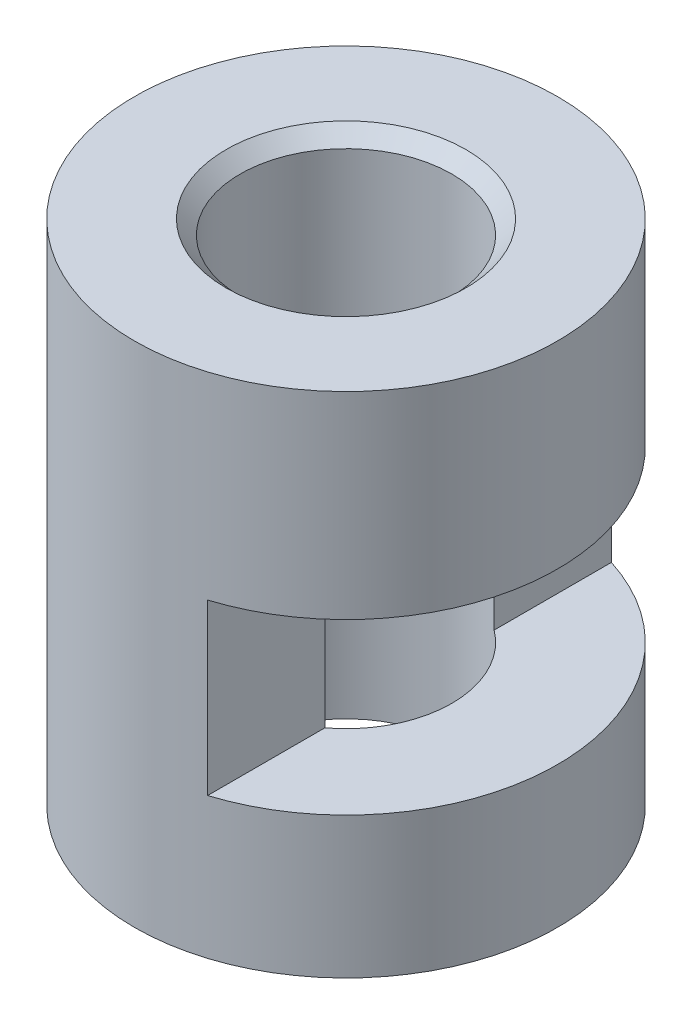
from build123d import *

# Parameters (mm, degrees)
SKETCH1_R               = 3
BOSS_EXTRUDE1_DEPTH     = 7.2
CUT_EXTRUDE1_REACH      = 10.357
SKETCH2_R               = 1.5
CUT_EXTRUDE2_DEPTH      = 9.357032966
CUT_EXTRUDE2_DEPTH_BACK = 9.357032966
SKETCH3_W               = 2.1
SKETCH3_H               = 2.4
CHAMFER1_SIZE           = 0.2


with BuildPart() as part:
    # Sketch1 → Boss-Extrude1 (new body)
    with BuildSketch(Plane(origin=(0, 0, 0), x_dir=(1, 0, 0), z_dir=(0, 1, 0))):
        with Locations(Location((0, 0, 0), (0, 0, 270))):
            Circle(SKETCH1_R)
    extrude(amount=BOSS_EXTRUDE1_DEPTH)

    # Sketch2 → Cut-Extrude1 (cut, up to next)
    with BuildSketch(Plane(origin=(0, 7.2, 0), x_dir=(1, 0, 0), z_dir=(0, 1, 0)), mode=Mode.PRIVATE) as cut_extrude1_sk1:
        with Locations(Location((0, 0, 0), (0, 0, 270))):
            Circle(SKETCH2_R)
    cut_extrude1_tool1 = extrude(cut_extrude1_sk1.sketch, amount=-CUT_EXTRUDE1_REACH, mode=Mode.PRIVATE) & part.part
    add(cut_extrude1_tool1.solids().sort_by_distance((0, 7.2, 0))[0], mode=Mode.SUBTRACT)

    # Sketch3 → Cut-Extrude2 (cut, two sides: drawn at the far end of the back side and taken through both)
    with BuildSketch(Plane.XY.offset(-CUT_EXTRUDE2_DEPTH_BACK)):
        with Locations((1.95, 3.2)):
            Rectangle(SKETCH3_W, SKETCH3_H)
    extrude(amount=CUT_EXTRUDE2_DEPTH + CUT_EXTRUDE2_DEPTH_BACK, mode=Mode.SUBTRACT)

    # Chamfer1
    chamfer1_edges = [part.edges().sort_by_distance(p)[0] for p in [
        (0, 7.2, -1.5),
    ]]
    chamfer(chamfer1_edges, length=CHAMFER1_SIZE)


solid = part.part
